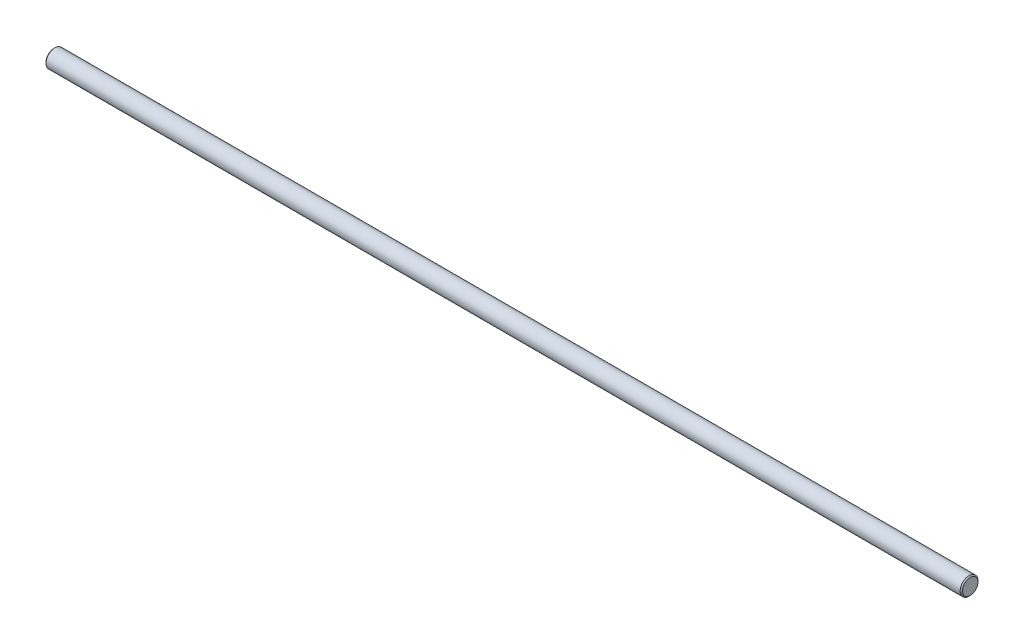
from build123d import *


with BuildPart() as part:
    # Sketch1 → Revolve1 (revolve)
    with BuildSketch(Plane.XY, mode=Mode.PRIVATE) as revolve1_sk:
        Polygon((0, 0), (0, 3.5), (0.5, 4), (409.5, 4), (410, 3.5), (410, 0), align=None)
    revolve(revolve1_sk.sketch.rotate(Axis((410, 0, 0), (-1, 0, 0)), 180), axis=Axis((410, 0, 0), (-1, 0, 0)))


solid = part.part
